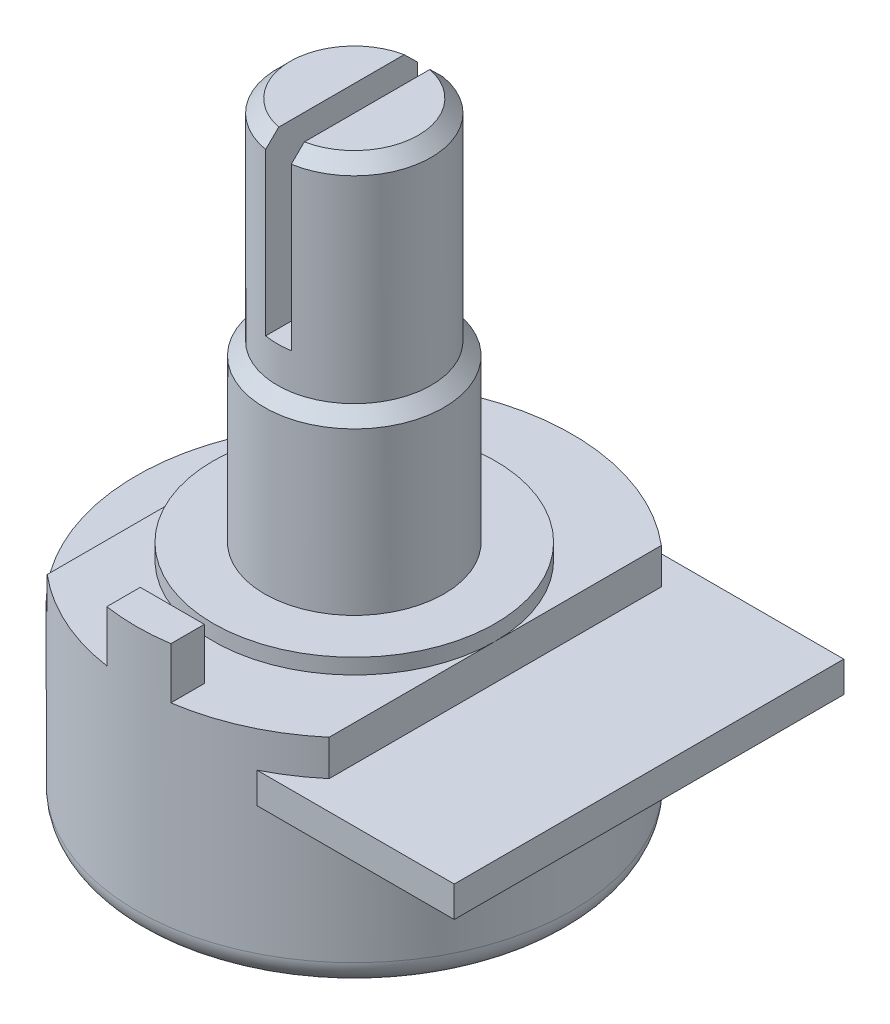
ISO-10303-21;
HEADER;
FILE_DESCRIPTION(('STEP AP214'),'2;1');
FILE_NAME('part.step','',(''),(''),'','','');
FILE_SCHEMA(('AUTOMOTIVE_DESIGN { 1 0 10303 214 1 1 1 1 }'));
ENDSEC;
DATA;
#1=APPLICATION_CONTEXT('core data for automotive mechanical design processes');
#2=APPLICATION_PROTOCOL_DEFINITION('international standard','automotive_design',2000,#1);
#3=PRODUCT_CONTEXT('',#1,'mechanical');
#4=PRODUCT('Part','Part','',(#3));
#5=PRODUCT_RELATED_PRODUCT_CATEGORY('part','',(#4));
#6=PRODUCT_DEFINITION_FORMATION('','',#4);
#7=PRODUCT_DEFINITION_CONTEXT('part definition',#1,'design');
#8=PRODUCT_DEFINITION('design','',#6,#7);
#9=PRODUCT_DEFINITION_SHAPE('','',#8);
#10=(LENGTH_UNIT() NAMED_UNIT(*) SI_UNIT(.MILLI.,.METRE.));
#11=(NAMED_UNIT(*) PLANE_ANGLE_UNIT() SI_UNIT($,.RADIAN.));
#12=(NAMED_UNIT(*) SI_UNIT($,.STERADIAN.) SOLID_ANGLE_UNIT());
#13=UNCERTAINTY_MEASURE_WITH_UNIT(LENGTH_MEASURE(1.E-05),#10,'distance_accuracy_value','');
#14=(GEOMETRIC_REPRESENTATION_CONTEXT(3) GLOBAL_UNCERTAINTY_ASSIGNED_CONTEXT((#13)) GLOBAL_UNIT_ASSIGNED_CONTEXT((#10,
#11,#12)) REPRESENTATION_CONTEXT('',''));
#15=CARTESIAN_POINT('',(0.,0.,0.));
#16=DIRECTION('',(0.,0.,1.));
#17=DIRECTION('',(1.,0.,0.));
#18=AXIS2_PLACEMENT_3D('',#15,#16,#17);
#19=CARTESIAN_POINT('',(0.,24.2,0.));
#20=DIRECTION('',(0.,1.,0.));
#21=DIRECTION('',(0.,0.,1.));
#22=AXIS2_PLACEMENT_3D('',#19,#20,#21);
#23=PLANE('',#22);
#24=DIRECTION('',(0.,0.,1.));
#25=VECTOR('',#24,1.);
#26=CARTESIAN_POINT('',(0.5,24.2,-8.5));
#27=LINE('',#26,#25);
#28=CARTESIAN_POINT('',(0.5,24.2,-2.44948974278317));
#29=VERTEX_POINT('',#28);
#30=CARTESIAN_POINT('',(0.5,24.2,2.44948974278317));
#31=VERTEX_POINT('',#30);
#32=EDGE_CURVE('E183',#29,#31,#27,.T.);
#33=ORIENTED_EDGE('',*,*,#32,.T.);
#34=CARTESIAN_POINT('',(0.,24.2,0.));
#35=DIRECTION('',(0.,1.,0.));
#36=DIRECTION('',(0.,0.,1.));
#37=AXIS2_PLACEMENT_3D('',#34,#35,#36);
#38=CIRCLE('',#37,2.5);
#39=EDGE_CURVE('E186',#31,#29,#38,.T.);
#40=ORIENTED_EDGE('',*,*,#39,.T.);
#41=EDGE_LOOP('',(#33,#40));
#42=FACE_BOUND('',#41,.T.);
#43=ADVANCED_FACE('F36',(#42),#23,.T.);
#44=CARTESIAN_POINT('',(0.,24.2,0.));
#45=DIRECTION('',(0.,-1.,0.));
#46=DIRECTION('',(0.,0.,-1.));
#47=AXIS2_PLACEMENT_3D('',#44,#45,#46);
#48=CONICAL_SURFACE('',#47,2.5,0.785398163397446);
#49=CARTESIAN_POINT('',(0.5,20.0873216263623,6.59374819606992));
#50=CARTESIAN_POINT('',(0.5,20.3201825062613,6.36021293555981));
#51=CARTESIAN_POINT('',(0.5,20.5530134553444,6.12664780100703));
#52=CARTESIAN_POINT('',(0.5,21.0185830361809,5.65940877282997));
#53=CARTESIAN_POINT('',(0.5,21.2513216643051,5.42573487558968));
#54=CARTESIAN_POINT('',(0.5,21.7168612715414,4.95804128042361));
#55=CARTESIAN_POINT('',(0.5,21.9496621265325,4.72402145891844));
#56=CARTESIAN_POINT('',(0.5,22.4150358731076,4.25577153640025));
#57=CARTESIAN_POINT('',(0.5,22.6476087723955,4.02154144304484));
#58=CARTESIAN_POINT('',(0.5,23.1023274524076,3.56288179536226));
#59=CARTESIAN_POINT('',(0.5,23.324488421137,3.3384673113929));
#60=CARTESIAN_POINT('',(0.5,23.6572956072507,3.00139301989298));
#61=CARTESIAN_POINT('',(0.5,23.7681648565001,2.8889534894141));
#62=CARTESIAN_POINT('',(0.5,23.9896895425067,2.66386624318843));
#63=CARTESIAN_POINT('',(0.5,24.1003449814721,2.55121852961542));
#64=CARTESIAN_POINT('',(0.5,24.321287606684,2.32568028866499));
#65=CARTESIAN_POINT('',(0.5,24.4315749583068,2.21278992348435));
#66=CARTESIAN_POINT('',(0.5,24.6516732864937,1.98653689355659));
#67=CARTESIAN_POINT('',(0.5,24.7614842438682,1.87317421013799));
#68=CARTESIAN_POINT('',(0.5,24.9802996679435,1.64570983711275));
#69=CARTESIAN_POINT('',(0.5,25.0893042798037,1.53160828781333));
#70=CARTESIAN_POINT('',(0.5,25.2516854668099,1.35940036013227));
#71=CARTESIAN_POINT('',(0.5,25.305623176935,1.30182366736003));
#72=CARTESIAN_POINT('',(0.5,25.4129477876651,1.18615978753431));
#73=CARTESIAN_POINT('',(0.5,25.4663347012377,1.12807261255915));
#74=CARTESIAN_POINT('',(0.5,25.5487123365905,1.03713543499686));
#75=CARTESIAN_POINT('',(0.5,25.5779944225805,1.00454958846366));
#76=CARTESIAN_POINT('',(0.5,25.6362199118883,0.939070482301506));
#77=CARTESIAN_POINT('',(0.5,25.6651632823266,0.906177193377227));
#78=CARTESIAN_POINT('',(0.5,25.7227976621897,0.839761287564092));
#79=CARTESIAN_POINT('',(0.5,25.7514854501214,0.806235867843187));
#80=CARTESIAN_POINT('',(0.5,25.8082171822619,0.738657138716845));
#81=CARTESIAN_POINT('',(0.5,25.8362612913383,0.704603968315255));
#82=CARTESIAN_POINT('',(0.5,25.8916619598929,0.635485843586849));
#83=CARTESIAN_POINT('',(0.5,25.9190111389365,0.600414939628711));
#84=CARTESIAN_POINT('',(0.5,25.9723138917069,0.529231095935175));
#85=CARTESIAN_POINT('',(0.5,25.9982678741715,0.493118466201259));
#86=CARTESIAN_POINT('',(0.5,26.0478319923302,0.419594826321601));
#87=CARTESIAN_POINT('',(0.5,26.0714545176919,0.382192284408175));
#88=CARTESIAN_POINT('',(0.5,26.1150024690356,0.305329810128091));
#89=CARTESIAN_POINT('',(0.5,26.1349377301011,0.265875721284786));
#90=CARTESIAN_POINT('',(0.5,26.1642427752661,0.194444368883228));
#91=CARTESIAN_POINT('',(0.5,26.1750078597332,0.163061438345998));
#92=CARTESIAN_POINT('',(0.5,26.1912190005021,0.0990206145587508));
#93=CARTESIAN_POINT('',(0.5,26.1966898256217,0.0663694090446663));
#94=CARTESIAN_POINT('',(0.5,26.2010914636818,0.000281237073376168));
#95=CARTESIAN_POINT('',(0.5,26.1999594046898,-0.0331602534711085));
#96=CARTESIAN_POINT('',(0.5,26.1913112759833,-0.0992592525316));
#97=CARTESIAN_POINT('',(0.5,26.1837737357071,-0.131913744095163));
#98=CARTESIAN_POINT('',(0.5,26.1663867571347,-0.187798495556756));
#99=CARTESIAN_POINT('',(0.5,26.1575631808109,-0.211369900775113));
#100=CARTESIAN_POINT('',(0.5,26.1379022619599,-0.257668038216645));
#101=CARTESIAN_POINT('',(0.5,26.1270633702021,-0.280394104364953));
#102=CARTESIAN_POINT('',(0.5,26.1038694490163,-0.325178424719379));
#103=CARTESIAN_POINT('',(0.5,26.091507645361,-0.347233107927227));
#104=CARTESIAN_POINT('',(0.5,26.0657050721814,-0.390683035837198));
#105=CARTESIAN_POINT('',(0.5,26.0522647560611,-0.412078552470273));
#106=CARTESIAN_POINT('',(0.5,26.00544728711,-0.483603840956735));
#107=CARTESIAN_POINT('',(0.5,25.9702237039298,-0.532516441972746));
#108=CARTESIAN_POINT('',(0.5,25.8974197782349,-0.628567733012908));
#109=CARTESIAN_POINT('',(0.5,25.859837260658,-0.67570471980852));
#110=CARTESIAN_POINT('',(0.5,25.7831776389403,-0.768939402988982));
#111=CARTESIAN_POINT('',(0.5,25.7440970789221,-0.815034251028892));
#112=CARTESIAN_POINT('',(0.5,25.6650636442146,-0.906430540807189));
#113=CARTESIAN_POINT('',(0.5,25.6251111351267,-0.951732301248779));
#114=CARTESIAN_POINT('',(0.5,25.5445255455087,-1.04188765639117));
#115=CARTESIAN_POINT('',(0.5,25.503891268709,-1.08674017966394));
#116=CARTESIAN_POINT('',(0.5,25.422192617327,-1.17605917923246));
#117=CARTESIAN_POINT('',(0.5,25.3811281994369,-1.22052561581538));
#118=CARTESIAN_POINT('',(0.5,25.2576046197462,-1.35335702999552));
#119=CARTESIAN_POINT('',(0.5,25.1746872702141,-1.44129548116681));
#120=CARTESIAN_POINT('',(0.5,25.0089296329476,-1.6156835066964));
#121=CARTESIAN_POINT('',(0.5,24.9260958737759,-1.7021393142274));
#122=CARTESIAN_POINT('',(0.5,24.7599820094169,-1.87462143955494));
#123=CARTESIAN_POINT('',(0.5,24.6767019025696,-1.96064775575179));
#124=CARTESIAN_POINT('',(0.5,24.4264155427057,-2.21830410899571));
#125=CARTESIAN_POINT('',(0.5,24.2589687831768,-2.38950577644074));
#126=CARTESIAN_POINT('',(0.5,23.9233730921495,-2.73142736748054));
#127=CARTESIAN_POINT('',(0.5,23.755223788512,-2.90214692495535));
#128=CARTESIAN_POINT('',(0.5,23.4185693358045,-3.24322955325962));
#129=CARTESIAN_POINT('',(0.5,23.2500641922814,-3.41359262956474));
#130=CARTESIAN_POINT('',(0.5,22.9132353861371,-3.75368251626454));
#131=CARTESIAN_POINT('',(0.5,22.7449122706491,-3.92340986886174));
#132=CARTESIAN_POINT('',(0.5,22.4081120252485,-4.26271303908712));
#133=CARTESIAN_POINT('',(0.5,22.2396348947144,-4.43228885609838));
#134=CARTESIAN_POINT('',(0.5,21.7340981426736,-4.94080349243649));
#135=CARTESIAN_POINT('',(0.5,21.396879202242,-5.27958390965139));
#136=CARTESIAN_POINT('',(0.5,20.9785831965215,-5.699531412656));
#137=CARTESIAN_POINT('',(0.5,20.8976145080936,-5.78080652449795));
#138=CARTESIAN_POINT('',(0.5,20.735662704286,-5.94334654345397));
#139=CARTESIAN_POINT('',(0.5,20.6546795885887,-6.02461145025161));
#140=CARTESIAN_POINT('',(0.5,20.4926384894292,-6.18719489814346));
#141=CARTESIAN_POINT('',(0.5,20.4115804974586,-6.26851343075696));
#142=CARTESIAN_POINT('',(0.5,20.2494569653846,-6.43113878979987));
#143=CARTESIAN_POINT('',(0.5,20.1683914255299,-6.51244561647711));
#144=CARTESIAN_POINT('',(0.5,20.0873216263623,-6.59374819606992));
#145=B_SPLINE_CURVE_WITH_KNOTS('',3,(#49,#50,#51,#52,#53,#54,#55,#56,#57,#58,#59,#60,#61,#62,
#63,#64,#65,#66,#67,#68,#69,#70,#71,#72,#73,#74,#75,#76,#77,#78,#79,#80,#81,#82,#83,#84,#85,#86,
#87,#88,#89,#90,#91,#92,#93,#94,#95,#96,#97,#98,#99,#100,#101,#102,#103,#104,#105,#106,#107,
#108,#109,#110,#111,#112,#113,#114,#115,#116,#117,#118,#119,#120,#121,#122,#123,#124,#125,#126,
#127,#128,#129,#130,#131,#132,#133,#134,#135,#136,#137,#138,#139,#140,#141,#142,#143,#144),
.UNSPECIFIED.,.F.,.F.,(4,2,2,2,2,2,2,2,2,2,2,2,2,2,2,2,2,2,2,2,2,2,2,2,2,2,2,2,2,2,2,2,2,2,2,2,
2,2,2,2,2,2,2,2,2,2,2,4),(0.,0.989376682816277,1.97878901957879,2.96906848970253,
3.95931325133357,4.90665416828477,5.38037513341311,5.8540911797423,6.32755372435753,
6.80103516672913,7.27442919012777,7.51111085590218,7.7477869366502,7.87921390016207,
8.01065351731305,8.14302053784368,8.27535326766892,8.40875456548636,8.54211656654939,
8.67472666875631,8.80697779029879,8.90619142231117,9.00493861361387,9.10462759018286,
9.20465203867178,9.28005397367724,9.35551411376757,9.43132293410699,9.50710004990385,
9.6877606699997,9.86859038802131,10.0498658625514,10.2310667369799,10.4126282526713,
10.5942082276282,10.956796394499,11.3159943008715,11.6751935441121,12.3936160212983,
13.1124856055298,13.8313440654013,14.5484634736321,15.2655857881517,16.6996005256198,
17.0437722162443,17.3879527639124,17.7324058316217,18.0768500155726),.UNSPECIFIED.);
#146=CARTESIAN_POINT('',(0.5,23.7,2.95803989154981));
#147=VERTEX_POINT('',#146);
#148=EDGE_CURVE('E311',#147,#31,#145,.T.);
#149=ORIENTED_EDGE('',*,*,#148,.F.);
#150=CARTESIAN_POINT('',(0.,23.7,0.));
#151=DIRECTION('',(0.,1.,0.));
#152=DIRECTION('',(0.,0.,1.));
#153=AXIS2_PLACEMENT_3D('',#150,#151,#152);
#154=CIRCLE('',#153,3.);
#155=CARTESIAN_POINT('',(0.5,23.7,-2.95803989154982));
#156=VERTEX_POINT('',#155);
#157=EDGE_CURVE('E190',#156,#147,#154,.F.);
#158=ORIENTED_EDGE('',*,*,#157,.F.);
#159=EDGE_CURVE('E175',#29,#156,#145,.T.);
#160=ORIENTED_EDGE('',*,*,#159,.F.);
#161=ORIENTED_EDGE('',*,*,#39,.F.);
#162=EDGE_LOOP('',(#149,#158,#160,#161));
#163=FACE_BOUND('',#162,.T.);
#164=ADVANCED_FACE('F255',(#163),#48,.T.);
#165=CARTESIAN_POINT('',(0.,8.6,0.));
#166=DIRECTION('',(0.,1.,0.));
#167=DIRECTION('',(0.,0.,1.));
#168=AXIS2_PLACEMENT_3D('',#165,#166,#167);
#169=PLANE('',#168);
#170=DIRECTION('',(-1.,0.,0.));
#171=VECTOR('',#170,1.);
#172=CARTESIAN_POINT('',(-1.25,8.6,7.1));
#173=LINE('',#172,#171);
#174=CARTESIAN_POINT('',(1.25,8.6,7.1));
#175=VERTEX_POINT('',#174);
#176=CARTESIAN_POINT('',(-1.25,8.6,7.1));
#177=VERTEX_POINT('',#176);
#178=EDGE_CURVE('E348',#175,#177,#173,.T.);
#179=ORIENTED_EDGE('',*,*,#178,.F.);
#180=DIRECTION('',(0.,0.,-1.));
#181=VECTOR('',#180,1.);
#182=CARTESIAN_POINT('',(1.25,8.6,8.40758586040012));
#183=LINE('',#182,#181);
#184=CARTESIAN_POINT('',(1.25,8.6,8.40758586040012));
#185=VERTEX_POINT('',#184);
#186=EDGE_CURVE('E335',#185,#175,#183,.T.);
#187=ORIENTED_EDGE('',*,*,#186,.F.);
#188=CARTESIAN_POINT('',(0.,8.6,0.));
#189=DIRECTION('',(0.,1.,0.));
#190=DIRECTION('',(0.,0.,1.));
#191=AXIS2_PLACEMENT_3D('',#188,#189,#190);
#192=CIRCLE('',#191,8.5);
#193=CARTESIAN_POINT('',(5.5,8.6,6.48074069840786));
#194=VERTEX_POINT('',#193);
#195=EDGE_CURVE('E377',#185,#194,#192,.T.);
#196=ORIENTED_EDGE('',*,*,#195,.T.);
#197=DIRECTION('',(0.,0.,-1.));
#198=VECTOR('',#197,1.);
#199=CARTESIAN_POINT('',(5.5,8.6,-6.48074069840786));
#200=LINE('',#199,#198);
#201=CARTESIAN_POINT('',(5.5,8.6,0.));
#202=VERTEX_POINT('',#201);
#203=EDGE_CURVE('E382',#194,#202,#200,.T.);
#204=ORIENTED_EDGE('',*,*,#203,.T.);
#205=CARTESIAN_POINT('',(0.,8.6,0.));
#206=DIRECTION('',(0.,1.,0.));
#207=DIRECTION('',(0.,0.,1.));
#208=AXIS2_PLACEMENT_3D('',#205,#206,#207);
#209=CIRCLE('',#208,5.5);
#210=CARTESIAN_POINT('',(-5.5,8.6,0.));
#211=VERTEX_POINT('',#210);
#212=EDGE_CURVE('E192',#211,#202,#209,.T.);
#213=ORIENTED_EDGE('',*,*,#212,.F.);
#214=DIRECTION('',(0.,0.,1.));
#215=VECTOR('',#214,1.);
#216=CARTESIAN_POINT('',(-5.5,8.6,-6.48074069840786));
#217=LINE('',#216,#215);
#218=CARTESIAN_POINT('',(-5.5,8.6,6.48074069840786));
#219=VERTEX_POINT('',#218);
#220=EDGE_CURVE('E372',#211,#219,#217,.T.);
#221=ORIENTED_EDGE('',*,*,#220,.T.);
#222=CARTESIAN_POINT('',(-1.25,8.6,8.40758586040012));
#223=VERTEX_POINT('',#222);
#224=EDGE_CURVE('E378',#219,#223,#192,.T.);
#225=ORIENTED_EDGE('',*,*,#224,.T.);
#226=DIRECTION('',(0.,0.,1.));
#227=VECTOR('',#226,1.);
#228=CARTESIAN_POINT('',(-1.25,8.6,8.40758586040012));
#229=LINE('',#228,#227);
#230=EDGE_CURVE('E340',#177,#223,#229,.T.);
#231=ORIENTED_EDGE('',*,*,#230,.F.);
#232=EDGE_LOOP('',(#179,#187,#196,#204,#213,#221,#225,#231));
#233=FACE_BOUND('',#232,.T.);
#234=ADVANCED_FACE('F247',(#233),#169,.T.);
#235=CARTESIAN_POINT('',(0.,9.2,0.));
#236=DIRECTION('',(0.,1.,0.));
#237=DIRECTION('',(0.,0.,1.));
#238=AXIS2_PLACEMENT_3D('',#235,#236,#237);
#239=PLANE('',#238);
#240=CARTESIAN_POINT('',(0.,9.2,0.));
#241=DIRECTION('',(0.,1.,0.));
#242=DIRECTION('',(0.,0.,1.));
#243=AXIS2_PLACEMENT_3D('',#240,#241,#242);
#244=CIRCLE('',#243,5.5);
#245=CARTESIAN_POINT('',(0.,9.2,5.5));
#246=VERTEX_POINT('',#245);
#247=EDGE_CURVE('E363',#246,#246,#244,.T.);
#248=ORIENTED_EDGE('',*,*,#247,.T.);
#249=EDGE_LOOP('',(#248));
#250=FACE_BOUND('',#249,.T.);
#251=CARTESIAN_POINT('',(0.,9.2,0.));
#252=DIRECTION('',(0.,1.,0.));
#253=DIRECTION('',(0.,0.,1.));
#254=AXIS2_PLACEMENT_3D('',#251,#252,#253);
#255=CIRCLE('',#254,3.5);
#256=CARTESIAN_POINT('',(0.,9.2,3.5));
#257=VERTEX_POINT('',#256);
#258=EDGE_CURVE('E359',#257,#257,#255,.T.);
#259=ORIENTED_EDGE('',*,*,#258,.F.);
#260=EDGE_LOOP('',(#259));
#261=FACE_BOUND('',#260,.T.);
#262=ADVANCED_FACE('F243',(#250,#261),#239,.T.);
#263=EDGE_CURVE('E362',#202,#211,#209,.T.);
#264=ORIENTED_EDGE('',*,*,#263,.F.);
#265=CARTESIAN_POINT('',(5.5,8.6,-6.48074069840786));
#266=VERTEX_POINT('',#265);
#267=EDGE_CURVE('E381',#202,#266,#200,.T.);
#268=ORIENTED_EDGE('',*,*,#267,.T.);
#269=CARTESIAN_POINT('',(0.,8.6,0.));
#270=DIRECTION('',(0.,1.,0.));
#271=DIRECTION('',(0.,0.,1.));
#272=AXIS2_PLACEMENT_3D('',#269,#270,#271);
#273=CIRCLE('',#272,8.5);
#274=CARTESIAN_POINT('',(-5.5,8.6,-6.48074069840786));
#275=VERTEX_POINT('',#274);
#276=EDGE_CURVE('E369',#266,#275,#273,.T.);
#277=ORIENTED_EDGE('',*,*,#276,.T.);
#278=EDGE_CURVE('E374',#275,#211,#217,.T.);
#279=ORIENTED_EDGE('',*,*,#278,.T.);
#280=EDGE_LOOP('',(#264,#268,#277,#279));
#281=FACE_BOUND('',#280,.T.);
#282=ADVANCED_FACE('F246',(#281),#169,.T.);
#283=CARTESIAN_POINT('',(0.,7.2,0.));
#284=DIRECTION('',(0.,1.,0.));
#285=DIRECTION('',(0.,0.,1.));
#286=AXIS2_PLACEMENT_3D('',#283,#284,#285);
#287=PLANE('',#286);
#288=CARTESIAN_POINT('',(0.,7.2,0.));
#289=DIRECTION('',(0.,1.,0.));
#290=DIRECTION('',(0.,0.,1.));
#291=AXIS2_PLACEMENT_3D('',#288,#289,#290);
#292=CIRCLE('',#291,8.5);
#293=CARTESIAN_POINT('',(5.5,7.2,-6.48074069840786));
#294=VERTEX_POINT('',#293);
#295=CARTESIAN_POINT('',(3.80657326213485,7.2,-7.6));
#296=VERTEX_POINT('',#295);
#297=EDGE_CURVE('E366',#294,#296,#292,.T.);
#298=ORIENTED_EDGE('',*,*,#297,.F.);
#299=DIRECTION('',(0.,0.,-1.));
#300=VECTOR('',#299,1.);
#301=CARTESIAN_POINT('',(5.5,7.2,-6.48074069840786));
#302=LINE('',#301,#300);
#303=CARTESIAN_POINT('',(5.5,7.2,6.48074069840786));
#304=VERTEX_POINT('',#303);
#305=EDGE_CURVE('E373',#304,#294,#302,.T.);
#306=ORIENTED_EDGE('',*,*,#305,.F.);
#307=CARTESIAN_POINT('',(0.,7.2,0.));
#308=DIRECTION('',(0.,1.,0.));
#309=DIRECTION('',(0.,0.,1.));
#310=AXIS2_PLACEMENT_3D('',#307,#308,#309);
#311=CIRCLE('',#310,8.5);
#312=CARTESIAN_POINT('',(3.80657326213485,7.2,7.6));
#313=VERTEX_POINT('',#312);
#314=EDGE_CURVE('E413',#313,#304,#311,.T.);
#315=ORIENTED_EDGE('',*,*,#314,.F.);
#316=DIRECTION('',(1.,0.,0.));
#317=VECTOR('',#316,1.);
#318=CARTESIAN_POINT('',(11.5,7.2,7.6));
#319=LINE('',#318,#317);
#320=CARTESIAN_POINT('',(11.5,7.2,7.6));
#321=VERTEX_POINT('',#320);
#322=EDGE_CURVE('E417',#313,#321,#319,.T.);
#323=ORIENTED_EDGE('',*,*,#322,.T.);
#324=DIRECTION('',(0.,0.,-1.));
#325=VECTOR('',#324,1.);
#326=CARTESIAN_POINT('',(11.5,7.2,7.6));
#327=LINE('',#326,#325);
#328=CARTESIAN_POINT('',(11.5,7.2,-7.6));
#329=VERTEX_POINT('',#328);
#330=EDGE_CURVE('E418',#321,#329,#327,.T.);
#331=ORIENTED_EDGE('',*,*,#330,.T.);
#332=DIRECTION('',(-1.,0.,0.));
#333=VECTOR('',#332,1.);
#334=CARTESIAN_POINT('',(11.5,7.2,-7.6));
#335=LINE('',#334,#333);
#336=EDGE_CURVE('E407',#329,#296,#335,.T.);
#337=ORIENTED_EDGE('',*,*,#336,.T.);
#338=EDGE_LOOP('',(#298,#306,#315,#323,#331,#337));
#339=FACE_BOUND('',#338,.T.);
#340=ADVANCED_FACE('F269',(#339),#287,.T.);
#341=CARTESIAN_POINT('',(0.,0.,0.));
#342=DIRECTION('',(0.,-1.,0.));
#343=DIRECTION('',(0.,0.,-1.));
#344=AXIS2_PLACEMENT_3D('',#341,#342,#343);
#345=PLANE('',#344);
#346=CARTESIAN_POINT('',(0.,0.,0.));
#347=DIRECTION('',(0.,-1.,0.));
#348=DIRECTION('',(0.,0.,-1.));
#349=AXIS2_PLACEMENT_3D('',#346,#347,#348);
#350=CIRCLE('',#349,7.5);
#351=CARTESIAN_POINT('',(0.,0.,-7.5));
#352=VERTEX_POINT('',#351);
#353=EDGE_CURVE('E416',#352,#352,#350,.T.);
#354=ORIENTED_EDGE('',*,*,#353,.T.);
#355=EDGE_LOOP('',(#354));
#356=FACE_BOUND('',#355,.T.);
#357=ADVANCED_FACE('F289',(#356),#345,.T.);
#358=CARTESIAN_POINT('',(0.,22.2531607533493,0.));
#359=DIRECTION('',(0.,1.,0.));
#360=DIRECTION('',(0.,0.,1.));
#361=AXIS2_PLACEMENT_3D('',#358,#359,#360);
#362=CYLINDRICAL_SURFACE('',#361,8.5);
#363=CARTESIAN_POINT('',(0.,1.,0.));
#364=DIRECTION('',(0.,-1.,0.));
#365=DIRECTION('',(0.,0.,-1.));
#366=AXIS2_PLACEMENT_3D('',#363,#364,#365);
#367=CIRCLE('',#366,8.5);
#368=CARTESIAN_POINT('',(0.,1.,-8.5));
#369=VERTEX_POINT('',#368);
#370=EDGE_CURVE('E444',#369,#369,#367,.F.);
#371=ORIENTED_EDGE('',*,*,#370,.T.);
#372=EDGE_LOOP('',(#371));
#373=FACE_BOUND('',#372,.T.);
#374=CARTESIAN_POINT('',(0.,6.,0.));
#375=DIRECTION('',(0.,1.,0.));
#376=DIRECTION('',(0.,0.,1.));
#377=AXIS2_PLACEMENT_3D('',#374,#375,#376);
#378=CIRCLE('',#377,8.5);
#379=CARTESIAN_POINT('',(3.80657326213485,6.,7.6));
#380=VERTEX_POINT('',#379);
#381=CARTESIAN_POINT('',(3.80657326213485,6.,-7.6));
#382=VERTEX_POINT('',#381);
#383=EDGE_CURVE('E447',#380,#382,#378,.T.);
#384=ORIENTED_EDGE('',*,*,#383,.F.);
#385=DIRECTION('',(0.,-1.,0.));
#386=VECTOR('',#385,1.);
#387=CARTESIAN_POINT('',(3.80657326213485,7.2,7.6));
#388=LINE('',#387,#386);
#389=EDGE_CURVE('E443',#313,#380,#388,.T.);
#390=ORIENTED_EDGE('',*,*,#389,.F.);
#391=ORIENTED_EDGE('',*,*,#314,.T.);
#392=DIRECTION('',(0.,-1.,0.));
#393=VECTOR('',#392,1.);
#394=CARTESIAN_POINT('',(5.5,8.6,6.48074069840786));
#395=LINE('',#394,#393);
#396=EDGE_CURVE('E399',#194,#304,#395,.T.);
#397=ORIENTED_EDGE('',*,*,#396,.F.);
#398=ORIENTED_EDGE('',*,*,#195,.F.);
#399=DIRECTION('',(0.,-1.,0.));
#400=VECTOR('',#399,1.);
#401=CARTESIAN_POINT('',(1.25,10.6,8.40758586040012));
#402=LINE('',#401,#400);
#403=CARTESIAN_POINT('',(1.25,10.6,8.40758586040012));
#404=VERTEX_POINT('',#403);
#405=EDGE_CURVE('E357',#404,#185,#402,.T.);
#406=ORIENTED_EDGE('',*,*,#405,.F.);
#407=CARTESIAN_POINT('',(0.,10.6,0.));
#408=DIRECTION('',(0.,1.,0.));
#409=DIRECTION('',(0.,0.,1.));
#410=AXIS2_PLACEMENT_3D('',#407,#408,#409);
#411=CIRCLE('',#410,8.5);
#412=CARTESIAN_POINT('',(-1.25,10.6,8.40758586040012));
#413=VERTEX_POINT('',#412);
#414=EDGE_CURVE('E336',#413,#404,#411,.T.);
#415=ORIENTED_EDGE('',*,*,#414,.F.);
#416=DIRECTION('',(0.,-1.,0.));
#417=VECTOR('',#416,1.);
#418=CARTESIAN_POINT('',(-1.25,10.6,8.40758586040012));
#419=LINE('',#418,#417);
#420=EDGE_CURVE('E346',#413,#223,#419,.T.);
#421=ORIENTED_EDGE('',*,*,#420,.T.);
#422=ORIENTED_EDGE('',*,*,#224,.F.);
#423=DIRECTION('',(0.,-1.,0.));
#424=VECTOR('',#423,1.);
#425=CARTESIAN_POINT('',(-5.5,8.6,6.48074069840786));
#426=LINE('',#425,#424);
#427=CARTESIAN_POINT('',(-5.5,7.2,6.48074069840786));
#428=VERTEX_POINT('',#427);
#429=EDGE_CURVE('E395',#219,#428,#426,.T.);
#430=ORIENTED_EDGE('',*,*,#429,.T.);
#431=CARTESIAN_POINT('',(0.,7.2,0.));
#432=DIRECTION('',(0.,1.,0.));
#433=DIRECTION('',(0.,0.,1.));
#434=AXIS2_PLACEMENT_3D('',#431,#432,#433);
#435=CIRCLE('',#434,8.5);
#436=CARTESIAN_POINT('',(-5.5,7.2,-6.48074069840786));
#437=VERTEX_POINT('',#436);
#438=EDGE_CURVE('E409',#437,#428,#435,.T.);
#439=ORIENTED_EDGE('',*,*,#438,.F.);
#440=DIRECTION('',(0.,-1.,0.));
#441=VECTOR('',#440,1.);
#442=CARTESIAN_POINT('',(-5.5,8.6,-6.48074069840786));
#443=LINE('',#442,#441);
#444=EDGE_CURVE('E398',#275,#437,#443,.T.);
#445=ORIENTED_EDGE('',*,*,#444,.F.);
#446=ORIENTED_EDGE('',*,*,#276,.F.);
#447=DIRECTION('',(0.,-1.,0.));
#448=VECTOR('',#447,1.);
#449=CARTESIAN_POINT('',(5.5,8.6,-6.48074069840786));
#450=LINE('',#449,#448);
#451=EDGE_CURVE('E384',#266,#294,#450,.T.);
#452=ORIENTED_EDGE('',*,*,#451,.T.);
#453=ORIENTED_EDGE('',*,*,#297,.T.);
#454=DIRECTION('',(0.,-1.,0.));
#455=VECTOR('',#454,1.);
#456=CARTESIAN_POINT('',(3.80657326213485,7.2,-7.6));
#457=LINE('',#456,#455);
#458=EDGE_CURVE('E451',#296,#382,#457,.T.);
#459=ORIENTED_EDGE('',*,*,#458,.T.);
#460=EDGE_LOOP('',(#384,#390,#391,#397,#398,#406,#415,#421,#422,#430,#439,#445,#446,#452,#453,#459));
#461=FACE_BOUND('',#460,.T.);
#462=ADVANCED_FACE('F286',(#373,#461),#362,.T.);
#463=CARTESIAN_POINT('',(0.,1.,0.));
#464=DIRECTION('',(0.,-1.,0.));
#465=DIRECTION('',(0.,0.,-1.));
#466=AXIS2_PLACEMENT_3D('',#463,#464,#465);
#467=TOROIDAL_SURFACE('',#466,7.5,1.);
#468=ORIENTED_EDGE('',*,*,#353,.F.);
#469=EDGE_LOOP('',(#468));
#470=FACE_BOUND('',#469,.T.);
#471=ORIENTED_EDGE('',*,*,#370,.F.);
#472=EDGE_LOOP('',(#471));
#473=FACE_BOUND('',#472,.T.);
#474=ADVANCED_FACE('F274',(#470,#473),#467,.T.);
#475=CARTESIAN_POINT('',(0.,6.,0.));
#476=DIRECTION('',(0.,1.,0.));
#477=DIRECTION('',(0.,0.,1.));
#478=AXIS2_PLACEMENT_3D('',#475,#476,#477);
#479=PLANE('',#478);
#480=DIRECTION('',(1.,0.,0.));
#481=VECTOR('',#480,1.);
#482=CARTESIAN_POINT('',(11.5,6.,7.6));
#483=LINE('',#482,#481);
#484=CARTESIAN_POINT('',(11.5,6.,7.6));
#485=VERTEX_POINT('',#484);
#486=EDGE_CURVE('E437',#380,#485,#483,.T.);
#487=ORIENTED_EDGE('',*,*,#486,.F.);
#488=ORIENTED_EDGE('',*,*,#383,.T.);
#489=DIRECTION('',(-1.,0.,0.));
#490=VECTOR('',#489,1.);
#491=CARTESIAN_POINT('',(11.5,6.,-7.6));
#492=LINE('',#491,#490);
#493=CARTESIAN_POINT('',(11.5,6.,-7.6));
#494=VERTEX_POINT('',#493);
#495=EDGE_CURVE('E404',#494,#382,#492,.T.);
#496=ORIENTED_EDGE('',*,*,#495,.F.);
#497=DIRECTION('',(0.,0.,-1.));
#498=VECTOR('',#497,1.);
#499=CARTESIAN_POINT('',(11.5,6.,7.6));
#500=LINE('',#499,#498);
#501=EDGE_CURVE('E410',#485,#494,#500,.T.);
#502=ORIENTED_EDGE('',*,*,#501,.F.);
#503=EDGE_LOOP('',(#487,#488,#496,#502));
#504=FACE_BOUND('',#503,.T.);
#505=ADVANCED_FACE('F270',(#504),#479,.F.);
#506=CARTESIAN_POINT('',(11.5,7.2,-7.6));
#507=DIRECTION('',(0.,0.,1.));
#508=DIRECTION('',(1.,0.,0.));
#509=AXIS2_PLACEMENT_3D('',#506,#507,#508);
#510=PLANE('',#509);
#511=ORIENTED_EDGE('',*,*,#495,.T.);
#512=ORIENTED_EDGE('',*,*,#458,.F.);
#513=ORIENTED_EDGE('',*,*,#336,.F.);
#514=DIRECTION('',(0.,-1.,0.));
#515=VECTOR('',#514,1.);
#516=CARTESIAN_POINT('',(11.5,7.2,-7.6));
#517=LINE('',#516,#515);
#518=EDGE_CURVE('E423',#329,#494,#517,.T.);
#519=ORIENTED_EDGE('',*,*,#518,.T.);
#520=EDGE_LOOP('',(#511,#512,#513,#519));
#521=FACE_BOUND('',#520,.T.);
#522=ADVANCED_FACE('F273',(#521),#510,.F.);
#523=CARTESIAN_POINT('',(11.5,7.2,7.6));
#524=DIRECTION('',(0.,0.,-1.));
#525=DIRECTION('',(-1.,0.,0.));
#526=AXIS2_PLACEMENT_3D('',#523,#524,#525);
#527=PLANE('',#526);
#528=ORIENTED_EDGE('',*,*,#486,.T.);
#529=DIRECTION('',(0.,-1.,0.));
#530=VECTOR('',#529,1.);
#531=CARTESIAN_POINT('',(11.5,7.2,7.6));
#532=LINE('',#531,#530);
#533=EDGE_CURVE('E440',#321,#485,#532,.T.);
#534=ORIENTED_EDGE('',*,*,#533,.F.);
#535=ORIENTED_EDGE('',*,*,#322,.F.);
#536=ORIENTED_EDGE('',*,*,#389,.T.);
#537=EDGE_LOOP('',(#528,#534,#535,#536));
#538=FACE_BOUND('',#537,.T.);
#539=ADVANCED_FACE('F278',(#538),#527,.F.);
#540=CARTESIAN_POINT('',(11.5,7.2,7.6));
#541=DIRECTION('',(-1.,0.,0.));
#542=DIRECTION('',(0.,0.,1.));
#543=AXIS2_PLACEMENT_3D('',#540,#541,#542);
#544=PLANE('',#543);
#545=ORIENTED_EDGE('',*,*,#501,.T.);
#546=ORIENTED_EDGE('',*,*,#518,.F.);
#547=ORIENTED_EDGE('',*,*,#330,.F.);
#548=ORIENTED_EDGE('',*,*,#533,.T.);
#549=EDGE_LOOP('',(#545,#546,#547,#548));
#550=FACE_BOUND('',#549,.T.);
#551=ADVANCED_FACE('F267',(#550),#544,.F.);
#552=DIRECTION('',(0.,0.,1.));
#553=VECTOR('',#552,1.);
#554=CARTESIAN_POINT('',(-5.5,7.2,-6.48074069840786));
#555=LINE('',#554,#553);
#556=EDGE_CURVE('E389',#437,#428,#555,.T.);
#557=ORIENTED_EDGE('',*,*,#556,.F.);
#558=ORIENTED_EDGE('',*,*,#438,.T.);
#559=EDGE_LOOP('',(#557,#558));
#560=FACE_BOUND('',#559,.T.);
#561=ADVANCED_FACE('F263',(#560),#287,.T.);
#562=CARTESIAN_POINT('',(-5.5,8.6,-6.48074069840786));
#563=DIRECTION('',(1.,0.,0.));
#564=DIRECTION('',(0.,0.,-1.));
#565=AXIS2_PLACEMENT_3D('',#562,#563,#564);
#566=PLANE('',#565);
#567=ORIENTED_EDGE('',*,*,#556,.T.);
#568=ORIENTED_EDGE('',*,*,#429,.F.);
#569=ORIENTED_EDGE('',*,*,#220,.F.);
#570=ORIENTED_EDGE('',*,*,#278,.F.);
#571=ORIENTED_EDGE('',*,*,#444,.T.);
#572=EDGE_LOOP('',(#567,#568,#569,#570,#571));
#573=FACE_BOUND('',#572,.T.);
#574=ADVANCED_FACE('F259',(#573),#566,.F.);
#575=CARTESIAN_POINT('',(5.5,8.6,-6.48074069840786));
#576=DIRECTION('',(-1.,0.,0.));
#577=DIRECTION('',(0.,0.,1.));
#578=AXIS2_PLACEMENT_3D('',#575,#576,#577);
#579=PLANE('',#578);
#580=ORIENTED_EDGE('',*,*,#305,.T.);
#581=ORIENTED_EDGE('',*,*,#451,.F.);
#582=ORIENTED_EDGE('',*,*,#267,.F.);
#583=ORIENTED_EDGE('',*,*,#203,.F.);
#584=ORIENTED_EDGE('',*,*,#396,.T.);
#585=EDGE_LOOP('',(#580,#581,#582,#583,#584));
#586=FACE_BOUND('',#585,.T.);
#587=ADVANCED_FACE('F251',(#586),#579,.F.);
#588=CARTESIAN_POINT('',(0.,9.2,0.));
#589=DIRECTION('',(0.,-1.,0.));
#590=DIRECTION('',(0.,0.,-1.));
#591=AXIS2_PLACEMENT_3D('',#588,#589,#590);
#592=CYLINDRICAL_SURFACE('',#591,5.5);
#593=ORIENTED_EDGE('',*,*,#247,.F.);
#594=EDGE_LOOP('',(#593));
#595=FACE_BOUND('',#594,.T.);
#596=ORIENTED_EDGE('',*,*,#263,.T.);
#597=ORIENTED_EDGE('',*,*,#212,.T.);
#598=EDGE_LOOP('',(#596,#597));
#599=FACE_BOUND('',#598,.T.);
#600=ADVANCED_FACE('F241',(#595,#599),#592,.T.);
#601=CARTESIAN_POINT('',(0.,41.8994949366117,0.));
#602=DIRECTION('',(0.,-1.,0.));
#603=DIRECTION('',(0.,0.,-1.));
#604=AXIS2_PLACEMENT_3D('',#601,#602,#603);
#605=CYLINDRICAL_SURFACE('',#604,3.5);
#606=CARTESIAN_POINT('',(0.,15.5,0.));
#607=DIRECTION('',(0.,-1.,0.));
#608=DIRECTION('',(0.,0.,-1.));
#609=AXIS2_PLACEMENT_3D('',#606,#607,#608);
#610=CIRCLE('',#609,3.5);
#611=CARTESIAN_POINT('',(0.,15.5,-3.5));
#612=VERTEX_POINT('',#611);
#613=EDGE_CURVE('E13',#612,#612,#610,.T.);
#614=ORIENTED_EDGE('',*,*,#613,.T.);
#615=EDGE_LOOP('',(#614));
#616=FACE_BOUND('',#615,.T.);
#617=ORIENTED_EDGE('',*,*,#258,.T.);
#618=EDGE_LOOP('',(#617));
#619=FACE_BOUND('',#618,.T.);
#620=ADVANCED_FACE('F237',(#616,#619),#605,.T.);
#621=CARTESIAN_POINT('',(0.,24.2,0.));
#622=DIRECTION('',(0.,-1.,0.));
#623=DIRECTION('',(0.,0.,-1.));
#624=AXIS2_PLACEMENT_3D('',#621,#622,#623);
#625=CYLINDRICAL_SURFACE('',#624,3.);
#626=CARTESIAN_POINT('',(0.,17.4,0.));
#627=DIRECTION('',(0.,-1.,0.));
#628=DIRECTION('',(0.,0.,-1.));
#629=AXIS2_PLACEMENT_3D('',#626,#627,#628);
#630=CIRCLE('',#629,3.);
#631=CARTESIAN_POINT('',(-0.5,17.4,-2.95803989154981));
#632=VERTEX_POINT('',#631);
#633=CARTESIAN_POINT('',(0.5,17.4,-2.95803989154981));
#634=VERTEX_POINT('',#633);
#635=EDGE_CURVE('E44',#632,#634,#630,.T.);
#636=ORIENTED_EDGE('',*,*,#635,.T.);
#637=DIRECTION('',(0.,-1.,0.));
#638=VECTOR('',#637,1.);
#639=CARTESIAN_POINT('',(0.5,24.2,-2.95803989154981));
#640=LINE('',#639,#638);
#641=EDGE_CURVE('E320',#634,#156,#640,.F.);
#642=ORIENTED_EDGE('',*,*,#641,.T.);
#643=ORIENTED_EDGE('',*,*,#157,.T.);
#644=DIRECTION('',(0.,-1.,0.));
#645=VECTOR('',#644,1.);
#646=CARTESIAN_POINT('',(0.5,24.2,2.95803989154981));
#647=LINE('',#646,#645);
#648=CARTESIAN_POINT('',(0.5,17.4,2.95803989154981));
#649=VERTEX_POINT('',#648);
#650=EDGE_CURVE('E333',#147,#649,#647,.T.);
#651=ORIENTED_EDGE('',*,*,#650,.T.);
#652=CARTESIAN_POINT('',(-0.5,17.4,2.95803989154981));
#653=VERTEX_POINT('',#652);
#654=EDGE_CURVE('E314',#649,#653,#630,.T.);
#655=ORIENTED_EDGE('',*,*,#654,.T.);
#656=DIRECTION('',(0.,-1.,0.));
#657=VECTOR('',#656,1.);
#658=CARTESIAN_POINT('',(-0.5,24.2,2.95803989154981));
#659=LINE('',#658,#657);
#660=CARTESIAN_POINT('',(-0.5,23.7,2.95803989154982));
#661=VERTEX_POINT('',#660);
#662=EDGE_CURVE('E326',#653,#661,#659,.F.);
#663=ORIENTED_EDGE('',*,*,#662,.T.);
#664=CARTESIAN_POINT('',(-0.5,23.7,-2.95803989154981));
#665=VERTEX_POINT('',#664);
#666=EDGE_CURVE('E196',#661,#665,#154,.F.);
#667=ORIENTED_EDGE('',*,*,#666,.T.);
#668=DIRECTION('',(0.,-1.,0.));
#669=VECTOR('',#668,1.);
#670=CARTESIAN_POINT('',(-0.5,24.2,-2.95803989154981));
#671=LINE('',#670,#669);
#672=EDGE_CURVE('E170',#665,#632,#671,.T.);
#673=ORIENTED_EDGE('',*,*,#672,.T.);
#674=EDGE_LOOP('',(#636,#642,#643,#651,#655,#663,#667,#673));
#675=FACE_BOUND('',#674,.T.);
#676=CARTESIAN_POINT('',(0.,16.,0.));
#677=DIRECTION('',(0.,-1.,0.));
#678=DIRECTION('',(0.,0.,-1.));
#679=AXIS2_PLACEMENT_3D('',#676,#677,#678);
#680=CIRCLE('',#679,3.);
#681=CARTESIAN_POINT('',(0.,16.,-3.));
#682=VERTEX_POINT('',#681);
#683=EDGE_CURVE('E187',#682,#682,#680,.F.);
#684=ORIENTED_EDGE('',*,*,#683,.T.);
#685=EDGE_LOOP('',(#684));
#686=FACE_BOUND('',#685,.T.);
#687=ADVANCED_FACE('F234',(#675,#686),#625,.T.);
#688=DIRECTION('',(0.,0.,1.));
#689=VECTOR('',#688,1.);
#690=CARTESIAN_POINT('',(-0.5,24.2,-8.5));
#691=LINE('',#690,#689);
#692=CARTESIAN_POINT('',(-0.5,24.2,-2.44948974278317));
#693=VERTEX_POINT('',#692);
#694=CARTESIAN_POINT('',(-0.5,24.2,2.44948974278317));
#695=VERTEX_POINT('',#694);
#696=EDGE_CURVE('E51',#693,#695,#691,.T.);
#697=ORIENTED_EDGE('',*,*,#696,.F.);
#698=EDGE_CURVE('E181',#693,#695,#38,.T.);
#699=ORIENTED_EDGE('',*,*,#698,.T.);
#700=EDGE_LOOP('',(#697,#699));
#701=FACE_BOUND('',#700,.T.);
#702=ADVANCED_FACE('F180',(#701),#23,.T.);
#703=CARTESIAN_POINT('',(1.25,10.6,8.40758586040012));
#704=DIRECTION('',(-1.,0.,0.));
#705=DIRECTION('',(0.,0.,1.));
#706=AXIS2_PLACEMENT_3D('',#703,#704,#705);
#707=PLANE('',#706);
#708=ORIENTED_EDGE('',*,*,#186,.T.);
#709=DIRECTION('',(0.,-1.,0.));
#710=VECTOR('',#709,1.);
#711=CARTESIAN_POINT('',(1.25,10.6,7.1));
#712=LINE('',#711,#710);
#713=CARTESIAN_POINT('',(1.25,10.6,7.1));
#714=VERTEX_POINT('',#713);
#715=EDGE_CURVE('E354',#714,#175,#712,.T.);
#716=ORIENTED_EDGE('',*,*,#715,.F.);
#717=DIRECTION('',(0.,0.,-1.));
#718=VECTOR('',#717,1.);
#719=CARTESIAN_POINT('',(1.25,10.6,8.40758586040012));
#720=LINE('',#719,#718);
#721=EDGE_CURVE('E339',#404,#714,#720,.T.);
#722=ORIENTED_EDGE('',*,*,#721,.F.);
#723=ORIENTED_EDGE('',*,*,#405,.T.);
#724=EDGE_LOOP('',(#708,#716,#722,#723));
#725=FACE_BOUND('',#724,.T.);
#726=ADVANCED_FACE('F227',(#725),#707,.F.);
#727=CARTESIAN_POINT('',(-1.25,10.6,7.1));
#728=DIRECTION('',(0.,0.,1.));
#729=DIRECTION('',(1.,0.,0.));
#730=AXIS2_PLACEMENT_3D('',#727,#728,#729);
#731=PLANE('',#730);
#732=ORIENTED_EDGE('',*,*,#178,.T.);
#733=DIRECTION('',(0.,-1.,0.));
#734=VECTOR('',#733,1.);
#735=CARTESIAN_POINT('',(-1.25,10.6,7.1));
#736=LINE('',#735,#734);
#737=CARTESIAN_POINT('',(-1.25,10.6,7.1));
#738=VERTEX_POINT('',#737);
#739=EDGE_CURVE('E59',#738,#177,#736,.T.);
#740=ORIENTED_EDGE('',*,*,#739,.F.);
#741=DIRECTION('',(-1.,0.,0.));
#742=VECTOR('',#741,1.);
#743=CARTESIAN_POINT('',(-1.25,10.6,7.1));
#744=LINE('',#743,#742);
#745=EDGE_CURVE('E342',#714,#738,#744,.T.);
#746=ORIENTED_EDGE('',*,*,#745,.F.);
#747=ORIENTED_EDGE('',*,*,#715,.T.);
#748=EDGE_LOOP('',(#732,#740,#746,#747));
#749=FACE_BOUND('',#748,.T.);
#750=ADVANCED_FACE('F224',(#749),#731,.F.);
#751=CARTESIAN_POINT('',(-1.25,10.6,8.40758586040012));
#752=DIRECTION('',(1.,0.,0.));
#753=DIRECTION('',(0.,0.,-1.));
#754=AXIS2_PLACEMENT_3D('',#751,#752,#753);
#755=PLANE('',#754);
#756=ORIENTED_EDGE('',*,*,#230,.T.);
#757=ORIENTED_EDGE('',*,*,#420,.F.);
#758=DIRECTION('',(0.,0.,1.));
#759=VECTOR('',#758,1.);
#760=CARTESIAN_POINT('',(-1.25,10.6,8.40758586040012));
#761=LINE('',#760,#759);
#762=EDGE_CURVE('E344',#738,#413,#761,.T.);
#763=ORIENTED_EDGE('',*,*,#762,.F.);
#764=ORIENTED_EDGE('',*,*,#739,.T.);
#765=EDGE_LOOP('',(#756,#757,#763,#764));
#766=FACE_BOUND('',#765,.T.);
#767=ADVANCED_FACE('F220',(#766),#755,.F.);
#768=CARTESIAN_POINT('',(0.,10.6,0.));
#769=DIRECTION('',(0.,1.,0.));
#770=DIRECTION('',(0.,0.,1.));
#771=AXIS2_PLACEMENT_3D('',#768,#769,#770);
#772=PLANE('',#771);
#773=ORIENTED_EDGE('',*,*,#414,.T.);
#774=ORIENTED_EDGE('',*,*,#721,.T.);
#775=ORIENTED_EDGE('',*,*,#745,.T.);
#776=ORIENTED_EDGE('',*,*,#762,.T.);
#777=EDGE_LOOP('',(#773,#774,#775,#776));
#778=FACE_BOUND('',#777,.T.);
#779=ADVANCED_FACE('F217',(#778),#772,.T.);
#780=CARTESIAN_POINT('',(-0.5,20.0873216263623,-6.59374819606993));
#781=CARTESIAN_POINT('',(-0.5,20.3201825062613,-6.36021293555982));
#782=CARTESIAN_POINT('',(-0.5,20.5530134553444,-6.12664780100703));
#783=CARTESIAN_POINT('',(-0.5,21.0185830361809,-5.65940877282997));
#784=CARTESIAN_POINT('',(-0.5,21.2513216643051,-5.42573487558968));
#785=CARTESIAN_POINT('',(-0.5,21.7168612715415,-4.9580412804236));
#786=CARTESIAN_POINT('',(-0.5,21.9496621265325,-4.72402145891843));
#787=CARTESIAN_POINT('',(-0.5,22.4150358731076,-4.25577153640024));
#788=CARTESIAN_POINT('',(-0.5,22.6476087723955,-4.02154144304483));
#789=CARTESIAN_POINT('',(-0.5,23.1023274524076,-3.56288179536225));
#790=CARTESIAN_POINT('',(-0.5,23.324488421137,-3.33846731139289));
#791=CARTESIAN_POINT('',(-0.5,23.6572956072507,-3.00139301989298));
#792=CARTESIAN_POINT('',(-0.5,23.7681648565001,-2.88895348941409));
#793=CARTESIAN_POINT('',(-0.5,23.9896895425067,-2.66386624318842));
#794=CARTESIAN_POINT('',(-0.5,24.1003449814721,-2.55121852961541));
#795=CARTESIAN_POINT('',(-0.5,24.321287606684,-2.32568028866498));
#796=CARTESIAN_POINT('',(-0.5,24.4315749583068,-2.21278992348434));
#797=CARTESIAN_POINT('',(-0.5,24.6516732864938,-1.98653689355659));
#798=CARTESIAN_POINT('',(-0.5,24.7614842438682,-1.87317421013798));
#799=CARTESIAN_POINT('',(-0.5,24.9802996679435,-1.64570983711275));
#800=CARTESIAN_POINT('',(-0.5,25.0893042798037,-1.53160828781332));
#801=CARTESIAN_POINT('',(-0.5,25.2516854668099,-1.35940036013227));
#802=CARTESIAN_POINT('',(-0.5,25.305623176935,-1.30182366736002));
#803=CARTESIAN_POINT('',(-0.5,25.4129477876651,-1.18615978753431));
#804=CARTESIAN_POINT('',(-0.5,25.4663347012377,-1.12807261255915));
#805=CARTESIAN_POINT('',(-0.5,25.5487123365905,-1.03713543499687));
#806=CARTESIAN_POINT('',(-0.5,25.5779944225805,-1.00454958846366));
#807=CARTESIAN_POINT('',(-0.5,25.6362199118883,-0.939070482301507));
#808=CARTESIAN_POINT('',(-0.5,25.6651632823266,-0.906177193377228));
#809=CARTESIAN_POINT('',(-0.5,25.7227976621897,-0.839761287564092));
#810=CARTESIAN_POINT('',(-0.5,25.7514854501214,-0.806235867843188));
#811=CARTESIAN_POINT('',(-0.5,25.8082171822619,-0.738657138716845));
#812=CARTESIAN_POINT('',(-0.5,25.8362612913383,-0.704603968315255));
#813=CARTESIAN_POINT('',(-0.5,25.8916619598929,-0.63548584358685));
#814=CARTESIAN_POINT('',(-0.5,25.9190111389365,-0.600414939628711));
#815=CARTESIAN_POINT('',(-0.5,25.9723138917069,-0.529231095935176));
#816=CARTESIAN_POINT('',(-0.5,25.9982678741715,-0.49311846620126));
#817=CARTESIAN_POINT('',(-0.5,26.0478319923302,-0.419594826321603));
#818=CARTESIAN_POINT('',(-0.5,26.0714545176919,-0.382192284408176));
#819=CARTESIAN_POINT('',(-0.5,26.1150024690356,-0.305329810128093));
#820=CARTESIAN_POINT('',(-0.5,26.1349377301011,-0.265875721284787));
#821=CARTESIAN_POINT('',(-0.5,26.1642427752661,-0.19444436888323));
#822=CARTESIAN_POINT('',(-0.5,26.1750078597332,-0.163061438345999));
#823=CARTESIAN_POINT('',(-0.5,26.1912190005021,-0.099020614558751));
#824=CARTESIAN_POINT('',(-0.5,26.1966898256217,-0.0663694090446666));
#825=CARTESIAN_POINT('',(-0.5,26.2010914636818,-0.000281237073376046));
#826=CARTESIAN_POINT('',(-0.5,26.1999594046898,0.033160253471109));
#827=CARTESIAN_POINT('',(-0.5,26.1913112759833,0.0992592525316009));
#828=CARTESIAN_POINT('',(-0.5,26.1837737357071,0.131913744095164));
#829=CARTESIAN_POINT('',(-0.5,26.1663867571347,0.187798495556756));
#830=CARTESIAN_POINT('',(-0.5,26.1575631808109,0.211369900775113));
#831=CARTESIAN_POINT('',(-0.5,26.1379022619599,0.257668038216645));
#832=CARTESIAN_POINT('',(-0.5,26.1270633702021,0.280394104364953));
#833=CARTESIAN_POINT('',(-0.5,26.1038694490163,0.325178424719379));
#834=CARTESIAN_POINT('',(-0.5,26.091507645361,0.347233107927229));
#835=CARTESIAN_POINT('',(-0.5,26.0657050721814,0.390683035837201));
#836=CARTESIAN_POINT('',(-0.5,26.0522647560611,0.412078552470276));
#837=CARTESIAN_POINT('',(-0.5,26.00544728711,0.483603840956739));
#838=CARTESIAN_POINT('',(-0.5,25.9702237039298,0.532516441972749));
#839=CARTESIAN_POINT('',(-0.5,25.8974197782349,0.62856773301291));
#840=CARTESIAN_POINT('',(-0.5,25.859837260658,0.675704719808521));
#841=CARTESIAN_POINT('',(-0.5,25.7831776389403,0.768939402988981));
#842=CARTESIAN_POINT('',(-0.5,25.7440970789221,0.81503425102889));
#843=CARTESIAN_POINT('',(-0.5,25.6650636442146,0.906430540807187));
#844=CARTESIAN_POINT('',(-0.5,25.6251111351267,0.951732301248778));
#845=CARTESIAN_POINT('',(-0.5,25.5445255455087,1.04188765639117));
#846=CARTESIAN_POINT('',(-0.5,25.503891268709,1.08674017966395));
#847=CARTESIAN_POINT('',(-0.5,25.422192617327,1.17605917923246));
#848=CARTESIAN_POINT('',(-0.5,25.3811281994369,1.22052561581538));
#849=CARTESIAN_POINT('',(-0.5,25.2576046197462,1.35335702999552));
#850=CARTESIAN_POINT('',(-0.5,25.1746872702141,1.44129548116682));
#851=CARTESIAN_POINT('',(-0.5,25.0089296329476,1.6156835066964));
#852=CARTESIAN_POINT('',(-0.5,24.9260958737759,1.70213931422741));
#853=CARTESIAN_POINT('',(-0.5,24.7599820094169,1.87462143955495));
#854=CARTESIAN_POINT('',(-0.5,24.6767019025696,1.9606477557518));
#855=CARTESIAN_POINT('',(-0.5,24.4264155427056,2.21830410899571));
#856=CARTESIAN_POINT('',(-0.5,24.2589687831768,2.38950577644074));
#857=CARTESIAN_POINT('',(-0.5,23.9233730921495,2.73142736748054));
#858=CARTESIAN_POINT('',(-0.5,23.755223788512,2.90214692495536));
#859=CARTESIAN_POINT('',(-0.5,23.4185693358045,3.24322955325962));
#860=CARTESIAN_POINT('',(-0.5,23.2500641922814,3.41359262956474));
#861=CARTESIAN_POINT('',(-0.5,22.9132353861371,3.75368251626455));
#862=CARTESIAN_POINT('',(-0.5,22.7449122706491,3.92340986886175));
#863=CARTESIAN_POINT('',(-0.5,22.4081120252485,4.26271303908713));
#864=CARTESIAN_POINT('',(-0.5,22.2396348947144,4.43228885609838));
#865=CARTESIAN_POINT('',(-0.5,21.7340981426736,4.9408034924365));
#866=CARTESIAN_POINT('',(-0.5,21.396879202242,5.2795839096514));
#867=CARTESIAN_POINT('',(-0.5,20.9785831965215,5.69953141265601));
#868=CARTESIAN_POINT('',(-0.5,20.8976145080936,5.78080652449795));
#869=CARTESIAN_POINT('',(-0.5,20.735662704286,5.94334654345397));
#870=CARTESIAN_POINT('',(-0.5,20.6546795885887,6.02461145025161));
#871=CARTESIAN_POINT('',(-0.5,20.4926384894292,6.18719489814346));
#872=CARTESIAN_POINT('',(-0.5,20.4115804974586,6.26851343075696));
#873=CARTESIAN_POINT('',(-0.5,20.2494569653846,6.43113878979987));
#874=CARTESIAN_POINT('',(-0.5,20.1683914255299,6.51244561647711));
#875=CARTESIAN_POINT('',(-0.5,20.0873216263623,6.59374819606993));
#876=B_SPLINE_CURVE_WITH_KNOTS('',3,(#780,#781,#782,#783,#784,#785,#786,#787,#788,#789,#790,
#791,#792,#793,#794,#795,#796,#797,#798,#799,#800,#801,#802,#803,#804,#805,#806,#807,#808,#809,
#810,#811,#812,#813,#814,#815,#816,#817,#818,#819,#820,#821,#822,#823,#824,#825,#826,#827,#828,
#829,#830,#831,#832,#833,#834,#835,#836,#837,#838,#839,#840,#841,#842,#843,#844,#845,#846,#847,
#848,#849,#850,#851,#852,#853,#854,#855,#856,#857,#858,#859,#860,#861,#862,#863,#864,#865,#866,
#867,#868,#869,#870,#871,#872,#873,#874,#875),.UNSPECIFIED.,.F.,.F.,(4,2,2,2,2,2,2,2,2,2,2,2,2,
2,2,2,2,2,2,2,2,2,2,2,2,2,2,2,2,2,2,2,2,2,2,2,2,2,2,2,2,2,2,2,2,2,2,4),(0.,0.989376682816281,
1.9787890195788,2.96906848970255,3.95931325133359,4.90665416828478,5.38037513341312,
5.85409117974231,6.32755372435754,6.80103516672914,7.27442919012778,7.51111085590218,
7.7477869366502,7.87921390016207,8.01065351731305,8.14302053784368,8.27535326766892,
8.40875456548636,8.54211656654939,8.67472666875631,8.80697779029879,8.90619142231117,
9.00493861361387,9.10462759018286,9.20465203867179,9.28005397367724,9.35551411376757,
9.43132293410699,9.50710004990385,9.6877606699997,9.86859038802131,10.0498658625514,
10.2310667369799,10.4126282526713,10.5942082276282,10.956796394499,11.3159943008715,
11.6751935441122,12.3936160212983,13.1124856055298,13.8313440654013,14.5484634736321,
15.2655857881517,16.6996005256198,17.0437722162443,17.3879527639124,17.7324058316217,
18.0768500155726),.UNSPECIFIED.);
#877=EDGE_CURVE('E166',#665,#693,#876,.T.);
#878=ORIENTED_EDGE('',*,*,#877,.F.);
#879=ORIENTED_EDGE('',*,*,#666,.F.);
#880=EDGE_CURVE('E176',#695,#661,#876,.T.);
#881=ORIENTED_EDGE('',*,*,#880,.F.);
#882=ORIENTED_EDGE('',*,*,#698,.F.);
#883=EDGE_LOOP('',(#878,#879,#881,#882));
#884=FACE_BOUND('',#883,.T.);
#885=ADVANCED_FACE('F185',(#884),#48,.T.);
#886=CARTESIAN_POINT('',(-0.5,17.4,-8.5));
#887=DIRECTION('',(0.,-1.,0.));
#888=DIRECTION('',(0.,0.,-1.));
#889=AXIS2_PLACEMENT_3D('',#886,#887,#888);
#890=PLANE('',#889);
#891=DIRECTION('',(0.,0.,1.));
#892=VECTOR('',#891,1.);
#893=CARTESIAN_POINT('',(0.5,17.4,-8.5));
#894=LINE('',#893,#892);
#895=EDGE_CURVE('E325',#634,#649,#894,.T.);
#896=ORIENTED_EDGE('',*,*,#895,.F.);
#897=ORIENTED_EDGE('',*,*,#635,.F.);
#898=DIRECTION('',(0.,0.,1.));
#899=VECTOR('',#898,1.);
#900=CARTESIAN_POINT('',(-0.5,17.4,-8.5));
#901=LINE('',#900,#899);
#902=EDGE_CURVE('E182',#632,#653,#901,.T.);
#903=ORIENTED_EDGE('',*,*,#902,.T.);
#904=ORIENTED_EDGE('',*,*,#654,.F.);
#905=EDGE_LOOP('',(#896,#897,#903,#904));
#906=FACE_BOUND('',#905,.T.);
#907=ADVANCED_FACE('F212',(#906),#890,.F.);
#908=CARTESIAN_POINT('',(0.5,17.4,-8.5));
#909=DIRECTION('',(1.,0.,0.));
#910=DIRECTION('',(0.,0.,-1.));
#911=AXIS2_PLACEMENT_3D('',#908,#909,#910);
#912=PLANE('',#911);
#913=ORIENTED_EDGE('',*,*,#148,.T.);
#914=ORIENTED_EDGE('',*,*,#32,.F.);
#915=ORIENTED_EDGE('',*,*,#159,.T.);
#916=ORIENTED_EDGE('',*,*,#641,.F.);
#917=ORIENTED_EDGE('',*,*,#895,.T.);
#918=ORIENTED_EDGE('',*,*,#650,.F.);
#919=EDGE_LOOP('',(#913,#914,#915,#916,#917,#918));
#920=FACE_BOUND('',#919,.T.);
#921=ADVANCED_FACE('F211',(#920),#912,.F.);
#922=CARTESIAN_POINT('',(-0.5,17.4,-8.5));
#923=DIRECTION('',(-1.,0.,0.));
#924=DIRECTION('',(0.,0.,1.));
#925=AXIS2_PLACEMENT_3D('',#922,#923,#924);
#926=PLANE('',#925);
#927=ORIENTED_EDGE('',*,*,#877,.T.);
#928=ORIENTED_EDGE('',*,*,#696,.T.);
#929=ORIENTED_EDGE('',*,*,#880,.T.);
#930=ORIENTED_EDGE('',*,*,#662,.F.);
#931=ORIENTED_EDGE('',*,*,#902,.F.);
#932=ORIENTED_EDGE('',*,*,#672,.F.);
#933=EDGE_LOOP('',(#927,#928,#929,#930,#931,#932));
#934=FACE_BOUND('',#933,.T.);
#935=ADVANCED_FACE('F167',(#934),#926,.F.);
#936=CARTESIAN_POINT('',(0.,15.5,0.));
#937=DIRECTION('',(0.,-1.,0.));
#938=DIRECTION('',(0.,0.,-1.));
#939=AXIS2_PLACEMENT_3D('',#936,#937,#938);
#940=CONICAL_SURFACE('',#939,3.5,0.785398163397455);
#941=ORIENTED_EDGE('',*,*,#683,.F.);
#942=EDGE_LOOP('',(#941));
#943=FACE_BOUND('',#942,.T.);
#944=ORIENTED_EDGE('',*,*,#613,.F.);
#945=EDGE_LOOP('',(#944));
#946=FACE_BOUND('',#945,.T.);
#947=ADVANCED_FACE('F38',(#943,#946),#940,.T.);
#948=CLOSED_SHELL('',(#43,#164,#234,#262,#282,#340,#357,#462,#474,#505,#522,#539,#551,#561,#574,
#587,#600,#620,#687,#702,#726,#750,#767,#779,#885,#907,#921,#935,#947));
#949=MANIFOLD_SOLID_BREP('B2',#948);
#950=ADVANCED_BREP_SHAPE_REPRESENTATION('',(#18,#949),#14);
#951=SHAPE_DEFINITION_REPRESENTATION(#9,#950);
ENDSEC;
END-ISO-10303-21;
